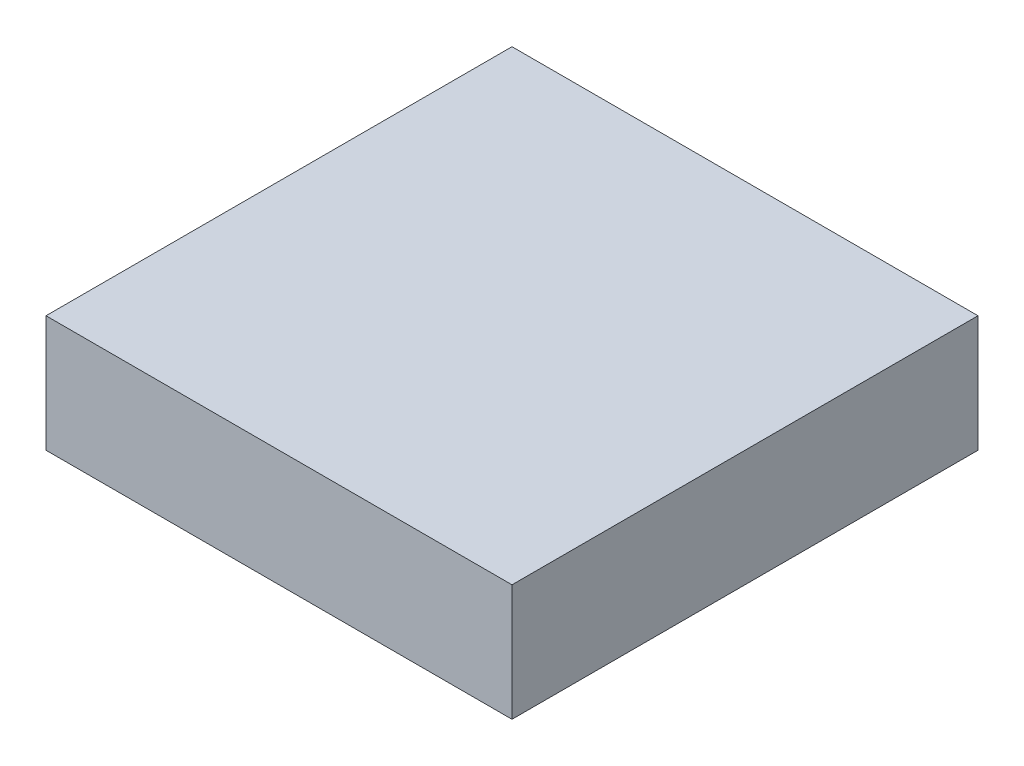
from build123d import *

# Parameters (mm, degrees)
SKIZZE1_W               = 20
SKIZZE1_H               = 20
LINEAR_AUSTRAGEN1_DEPTH = 2.5


with BuildPart() as part:
    # Skizze1 → Linear austragen1 (new, symmetric)
    with BuildSketch(Plane(origin=(0, 0, 0), x_dir=(-1, 0, 0), z_dir=(0, 1, 0))):
        Rectangle(SKIZZE1_W, SKIZZE1_H)
    extrude(amount=LINEAR_AUSTRAGEN1_DEPTH, both=True)


solid = part.part
